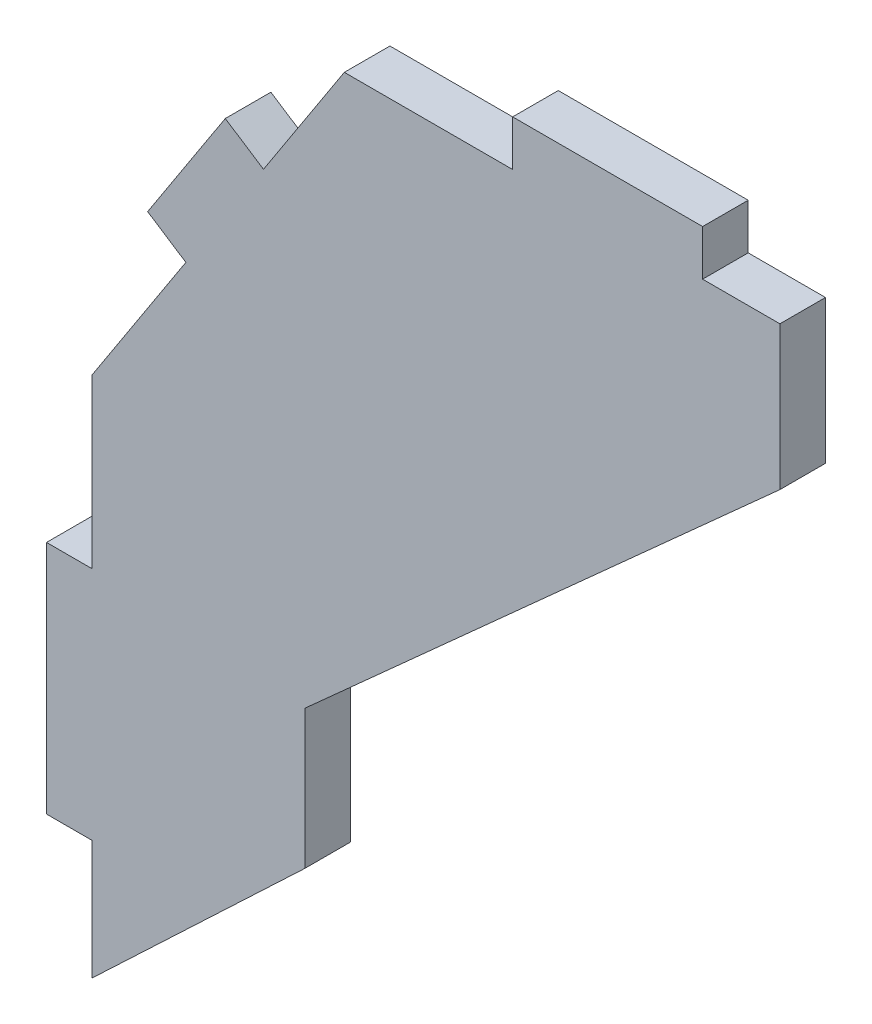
ISO-10303-21;
HEADER;
FILE_DESCRIPTION(('STEP AP214'),'2;1');
FILE_NAME('part.step','',(''),(''),'','','');
FILE_SCHEMA(('AUTOMOTIVE_DESIGN { 1 0 10303 214 1 1 1 1 }'));
ENDSEC;
DATA;
#1=APPLICATION_CONTEXT('core data for automotive mechanical design processes');
#2=APPLICATION_PROTOCOL_DEFINITION('international standard','automotive_design',2000,#1);
#3=PRODUCT_CONTEXT('',#1,'mechanical');
#4=PRODUCT('Part','Part','',(#3));
#5=PRODUCT_RELATED_PRODUCT_CATEGORY('part','',(#4));
#6=PRODUCT_DEFINITION_FORMATION('','',#4);
#7=PRODUCT_DEFINITION_CONTEXT('part definition',#1,'design');
#8=PRODUCT_DEFINITION('design','',#6,#7);
#9=PRODUCT_DEFINITION_SHAPE('','',#8);
#10=(LENGTH_UNIT() NAMED_UNIT(*) SI_UNIT(.MILLI.,.METRE.));
#11=(NAMED_UNIT(*) PLANE_ANGLE_UNIT() SI_UNIT($,.RADIAN.));
#12=(NAMED_UNIT(*) SI_UNIT($,.STERADIAN.) SOLID_ANGLE_UNIT());
#13=UNCERTAINTY_MEASURE_WITH_UNIT(LENGTH_MEASURE(1.E-05),#10,'distance_accuracy_value','');
#14=(GEOMETRIC_REPRESENTATION_CONTEXT(3) GLOBAL_UNCERTAINTY_ASSIGNED_CONTEXT((#13)) GLOBAL_UNIT_ASSIGNED_CONTEXT((#10,
#11,#12)) REPRESENTATION_CONTEXT('',''));
#15=CARTESIAN_POINT('',(0.,0.,0.));
#16=DIRECTION('',(0.,0.,1.));
#17=DIRECTION('',(1.,0.,0.));
#18=AXIS2_PLACEMENT_3D('',#15,#16,#17);
#19=CARTESIAN_POINT('',(0.,171.841179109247,1.524));
#20=DIRECTION('',(1.,0.,0.));
#21=DIRECTION('',(0.,0.,-1.));
#22=AXIS2_PLACEMENT_3D('',#19,#20,#21);
#23=PLANE('',#22);
#24=DIRECTION('',(0.,-1.,0.));
#25=VECTOR('',#24,1.);
#26=CARTESIAN_POINT('',(0.,171.841179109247,0.));
#27=LINE('',#26,#25);
#28=CARTESIAN_POINT('',(0.,177.453164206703,0.));
#29=VERTEX_POINT('',#28);
#30=CARTESIAN_POINT('',(0.,171.841179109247,0.));
#31=VERTEX_POINT('',#30);
#32=EDGE_CURVE('E198',#29,#31,#27,.T.);
#33=ORIENTED_EDGE('',*,*,#32,.T.);
#34=DIRECTION('',(0.,0.,-1.));
#35=VECTOR('',#34,1.);
#36=CARTESIAN_POINT('',(0.,171.841179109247,1.524));
#37=LINE('',#36,#35);
#38=CARTESIAN_POINT('',(0.,171.841179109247,1.524));
#39=VERTEX_POINT('',#38);
#40=EDGE_CURVE('E11',#39,#31,#37,.T.);
#41=ORIENTED_EDGE('',*,*,#40,.F.);
#42=DIRECTION('',(0.,-1.,0.));
#43=VECTOR('',#42,1.);
#44=CARTESIAN_POINT('',(0.,171.841179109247,1.524));
#45=LINE('',#44,#43);
#46=CARTESIAN_POINT('',(0.,177.453164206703,1.524));
#47=VERTEX_POINT('',#46);
#48=EDGE_CURVE('E234',#47,#39,#45,.T.);
#49=ORIENTED_EDGE('',*,*,#48,.F.);
#50=DIRECTION('',(0.,0.,-1.));
#51=VECTOR('',#50,1.);
#52=CARTESIAN_POINT('',(0.,177.453164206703,1.524));
#53=LINE('',#52,#51);
#54=EDGE_CURVE('E194',#47,#29,#53,.T.);
#55=ORIENTED_EDGE('',*,*,#54,.T.);
#56=EDGE_LOOP('',(#33,#41,#49,#55));
#57=FACE_BOUND('',#56,.T.);
#58=ADVANCED_FACE('F36',(#57),#23,.F.);
#59=CARTESIAN_POINT('',(0.,171.841179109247,1.524));
#60=DIRECTION('',(0.,-1.,0.));
#61=DIRECTION('',(0.,0.,-1.));
#62=AXIS2_PLACEMENT_3D('',#59,#60,#61);
#63=PLANE('',#62);
#64=DIRECTION('',(-1.,0.,0.));
#65=VECTOR('',#64,1.);
#66=CARTESIAN_POINT('',(0.,171.841179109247,0.));
#67=LINE('',#66,#65);
#68=CARTESIAN_POINT('',(-1.524,171.841179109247,0.));
#69=VERTEX_POINT('',#68);
#70=EDGE_CURVE('E201',#31,#69,#67,.T.);
#71=ORIENTED_EDGE('',*,*,#70,.T.);
#72=DIRECTION('',(0.,0.,-1.));
#73=VECTOR('',#72,1.);
#74=CARTESIAN_POINT('',(-1.524,171.841179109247,1.524));
#75=LINE('',#74,#73);
#76=CARTESIAN_POINT('',(-1.524,171.841179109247,1.524));
#77=VERTEX_POINT('',#76);
#78=EDGE_CURVE('E44',#77,#69,#75,.T.);
#79=ORIENTED_EDGE('',*,*,#78,.F.);
#80=DIRECTION('',(-1.,0.,0.));
#81=VECTOR('',#80,1.);
#82=CARTESIAN_POINT('',(0.,171.841179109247,1.524));
#83=LINE('',#82,#81);
#84=EDGE_CURVE('E128',#39,#77,#83,.T.);
#85=ORIENTED_EDGE('',*,*,#84,.F.);
#86=ORIENTED_EDGE('',*,*,#40,.T.);
#87=EDGE_LOOP('',(#71,#79,#85,#86));
#88=FACE_BOUND('',#87,.T.);
#89=ADVANCED_FACE('F347',(#88),#63,.F.);
#90=CARTESIAN_POINT('',(-1.524,171.841179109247,1.524));
#91=DIRECTION('',(1.,0.,0.));
#92=DIRECTION('',(0.,0.,-1.));
#93=AXIS2_PLACEMENT_3D('',#90,#91,#92);
#94=PLANE('',#93);
#95=DIRECTION('',(0.,-1.,0.));
#96=VECTOR('',#95,1.);
#97=CARTESIAN_POINT('',(-1.524,171.841179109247,0.));
#98=LINE('',#97,#96);
#99=CARTESIAN_POINT('',(-1.524,163.976275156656,0.));
#100=VERTEX_POINT('',#99);
#101=EDGE_CURVE('E203',#69,#100,#98,.T.);
#102=ORIENTED_EDGE('',*,*,#101,.T.);
#103=DIRECTION('',(0.,0.,-1.));
#104=VECTOR('',#103,1.);
#105=CARTESIAN_POINT('',(-1.524,163.976275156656,1.524));
#106=LINE('',#105,#104);
#107=CARTESIAN_POINT('',(-1.524,163.976275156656,1.524));
#108=VERTEX_POINT('',#107);
#109=EDGE_CURVE('E274',#108,#100,#106,.T.);
#110=ORIENTED_EDGE('',*,*,#109,.F.);
#111=DIRECTION('',(0.,-1.,0.));
#112=VECTOR('',#111,1.);
#113=CARTESIAN_POINT('',(-1.524,171.841179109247,1.524));
#114=LINE('',#113,#112);
#115=EDGE_CURVE('E282',#77,#108,#114,.T.);
#116=ORIENTED_EDGE('',*,*,#115,.F.);
#117=ORIENTED_EDGE('',*,*,#78,.T.);
#118=EDGE_LOOP('',(#102,#110,#116,#117));
#119=FACE_BOUND('',#118,.T.);
#120=ADVANCED_FACE('F280',(#119),#94,.F.);
#121=CARTESIAN_POINT('',(-1.524,163.976275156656,1.524));
#122=DIRECTION('',(0.,1.,0.));
#123=DIRECTION('',(0.,0.,1.));
#124=AXIS2_PLACEMENT_3D('',#121,#122,#123);
#125=PLANE('',#124);
#126=DIRECTION('',(1.,0.,0.));
#127=VECTOR('',#126,1.);
#128=CARTESIAN_POINT('',(-1.524,163.976275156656,0.));
#129=LINE('',#128,#127);
#130=CARTESIAN_POINT('',(0.,163.976275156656,0.));
#131=VERTEX_POINT('',#130);
#132=EDGE_CURVE('E205',#100,#131,#129,.T.);
#133=ORIENTED_EDGE('',*,*,#132,.T.);
#134=DIRECTION('',(0.,0.,-1.));
#135=VECTOR('',#134,1.);
#136=CARTESIAN_POINT('',(0.,163.976275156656,1.524));
#137=LINE('',#136,#135);
#138=CARTESIAN_POINT('',(0.,163.976275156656,1.524));
#139=VERTEX_POINT('',#138);
#140=EDGE_CURVE('E271',#139,#131,#137,.T.);
#141=ORIENTED_EDGE('',*,*,#140,.F.);
#142=DIRECTION('',(1.,0.,0.));
#143=VECTOR('',#142,1.);
#144=CARTESIAN_POINT('',(-1.524,163.976275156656,1.524));
#145=LINE('',#144,#143);
#146=EDGE_CURVE('E300',#108,#139,#145,.T.);
#147=ORIENTED_EDGE('',*,*,#146,.F.);
#148=ORIENTED_EDGE('',*,*,#109,.T.);
#149=EDGE_LOOP('',(#133,#141,#147,#148));
#150=FACE_BOUND('',#149,.T.);
#151=ADVANCED_FACE('F291',(#150),#125,.F.);
#152=CARTESIAN_POINT('',(0.,163.976275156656,1.524));
#153=DIRECTION('',(1.,0.,0.));
#154=DIRECTION('',(0.,0.,-1.));
#155=AXIS2_PLACEMENT_3D('',#152,#153,#154);
#156=PLANE('',#155);
#157=DIRECTION('',(0.,-1.,0.));
#158=VECTOR('',#157,1.);
#159=CARTESIAN_POINT('',(0.,163.976275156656,0.));
#160=LINE('',#159,#158);
#161=CARTESIAN_POINT('',(0.,159.993162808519,0.));
#162=VERTEX_POINT('',#161);
#163=EDGE_CURVE('E207',#131,#162,#160,.T.);
#164=ORIENTED_EDGE('',*,*,#163,.T.);
#165=DIRECTION('',(0.,0.,-1.));
#166=VECTOR('',#165,1.);
#167=CARTESIAN_POINT('',(0.,159.993162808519,1.524));
#168=LINE('',#167,#166);
#169=CARTESIAN_POINT('',(0.,159.993162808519,1.524));
#170=VERTEX_POINT('',#169);
#171=EDGE_CURVE('E268',#170,#162,#168,.T.);
#172=ORIENTED_EDGE('',*,*,#171,.F.);
#173=DIRECTION('',(0.,-1.,0.));
#174=VECTOR('',#173,1.);
#175=CARTESIAN_POINT('',(0.,163.976275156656,1.524));
#176=LINE('',#175,#174);
#177=EDGE_CURVE('E297',#139,#170,#176,.T.);
#178=ORIENTED_EDGE('',*,*,#177,.F.);
#179=ORIENTED_EDGE('',*,*,#140,.T.);
#180=EDGE_LOOP('',(#164,#172,#178,#179));
#181=FACE_BOUND('',#180,.T.);
#182=ADVANCED_FACE('F295',(#181),#156,.F.);
#183=CARTESIAN_POINT('',(0.,159.993162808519,1.524));
#184=DIRECTION('',(-0.687255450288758,0.72641582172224,0.));
#185=DIRECTION('',(-0.72641582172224,-0.687255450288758,0.));
#186=AXIS2_PLACEMENT_3D('',#183,#184,#185);
#187=PLANE('',#186);
#188=DIRECTION('',(0.72641582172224,0.687255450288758,0.));
#189=VECTOR('',#188,1.);
#190=CARTESIAN_POINT('',(0.,159.993162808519,0.));
#191=LINE('',#190,#189);
#192=CARTESIAN_POINT('',(7.11586618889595,166.725419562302,0.));
#193=VERTEX_POINT('',#192);
#194=EDGE_CURVE('E209',#162,#193,#191,.T.);
#195=ORIENTED_EDGE('',*,*,#194,.T.);
#196=DIRECTION('',(0.,0.,-1.));
#197=VECTOR('',#196,1.);
#198=CARTESIAN_POINT('',(7.11586618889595,166.725419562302,1.524));
#199=LINE('',#198,#197);
#200=CARTESIAN_POINT('',(7.11586618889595,166.725419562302,1.524));
#201=VERTEX_POINT('',#200);
#202=EDGE_CURVE('E265',#201,#193,#199,.T.);
#203=ORIENTED_EDGE('',*,*,#202,.F.);
#204=DIRECTION('',(0.72641582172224,0.687255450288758,0.));
#205=VECTOR('',#204,1.);
#206=CARTESIAN_POINT('',(0.,159.993162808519,1.524));
#207=LINE('',#206,#205);
#208=EDGE_CURVE('E299',#170,#201,#207,.T.);
#209=ORIENTED_EDGE('',*,*,#208,.F.);
#210=ORIENTED_EDGE('',*,*,#171,.T.);
#211=EDGE_LOOP('',(#195,#203,#209,#210));
#212=FACE_BOUND('',#211,.T.);
#213=ADVANCED_FACE('F360',(#212),#187,.F.);
#214=CARTESIAN_POINT('',(7.11586618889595,166.725419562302,1.524));
#215=DIRECTION('',(-1.,0.,0.));
#216=DIRECTION('',(0.,0.,1.));
#217=AXIS2_PLACEMENT_3D('',#214,#215,#216);
#218=PLANE('',#217);
#219=DIRECTION('',(0.,1.,0.));
#220=VECTOR('',#219,1.);
#221=CARTESIAN_POINT('',(7.11586618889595,166.725419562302,0.));
#222=LINE('',#221,#220);
#223=CARTESIAN_POINT('',(7.11586618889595,171.362408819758,0.));
#224=VERTEX_POINT('',#223);
#225=EDGE_CURVE('E211',#193,#224,#222,.T.);
#226=ORIENTED_EDGE('',*,*,#225,.T.);
#227=DIRECTION('',(0.,0.,-1.));
#228=VECTOR('',#227,1.);
#229=CARTESIAN_POINT('',(7.11586618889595,171.362408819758,1.524));
#230=LINE('',#229,#228);
#231=CARTESIAN_POINT('',(7.11586618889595,171.362408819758,1.524));
#232=VERTEX_POINT('',#231);
#233=EDGE_CURVE('E262',#232,#224,#230,.T.);
#234=ORIENTED_EDGE('',*,*,#233,.F.);
#235=DIRECTION('',(0.,1.,0.));
#236=VECTOR('',#235,1.);
#237=CARTESIAN_POINT('',(7.11586618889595,166.725419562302,1.524));
#238=LINE('',#237,#236);
#239=EDGE_CURVE('E302',#201,#232,#238,.T.);
#240=ORIENTED_EDGE('',*,*,#239,.F.);
#241=ORIENTED_EDGE('',*,*,#202,.T.);
#242=EDGE_LOOP('',(#226,#234,#240,#241));
#243=FACE_BOUND('',#242,.T.);
#244=ADVANCED_FACE('F363',(#243),#218,.F.);
#245=CARTESIAN_POINT('',(22.9917035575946,185.627136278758,1.524));
#246=DIRECTION('',(-0.668355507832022,0.743841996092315,0.));
#247=DIRECTION('',(-0.743841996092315,-0.668355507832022,0.));
#248=AXIS2_PLACEMENT_3D('',#245,#246,#247);
#249=PLANE('',#248);
#250=DIRECTION('',(0.743841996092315,0.668355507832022,0.));
#251=VECTOR('',#250,1.);
#252=CARTESIAN_POINT('',(22.9917035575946,185.627136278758,0.));
#253=LINE('',#252,#251);
#254=CARTESIAN_POINT('',(22.9917035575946,185.627136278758,0.));
#255=VERTEX_POINT('',#254);
#256=EDGE_CURVE('E213',#224,#255,#253,.T.);
#257=ORIENTED_EDGE('',*,*,#256,.T.);
#258=DIRECTION('',(0.,0.,-1.));
#259=VECTOR('',#258,1.);
#260=CARTESIAN_POINT('',(22.9917035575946,185.627136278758,1.524));
#261=LINE('',#260,#259);
#262=CARTESIAN_POINT('',(22.9917035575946,185.627136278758,1.524));
#263=VERTEX_POINT('',#262);
#264=EDGE_CURVE('E259',#263,#255,#261,.T.);
#265=ORIENTED_EDGE('',*,*,#264,.F.);
#266=DIRECTION('',(0.743841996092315,0.668355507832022,0.));
#267=VECTOR('',#266,1.);
#268=CARTESIAN_POINT('',(22.9917035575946,185.627136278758,1.524));
#269=LINE('',#268,#267);
#270=EDGE_CURVE('E308',#232,#263,#269,.T.);
#271=ORIENTED_EDGE('',*,*,#270,.F.);
#272=ORIENTED_EDGE('',*,*,#233,.T.);
#273=EDGE_LOOP('',(#257,#265,#271,#272));
#274=FACE_BOUND('',#273,.T.);
#275=ADVANCED_FACE('F367',(#274),#249,.F.);
#276=CARTESIAN_POINT('',(22.9917035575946,190.42807538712,1.524));
#277=DIRECTION('',(-1.,0.,0.));
#278=DIRECTION('',(0.,0.,1.));
#279=AXIS2_PLACEMENT_3D('',#276,#277,#278);
#280=PLANE('',#279);
#281=DIRECTION('',(0.,1.,0.));
#282=VECTOR('',#281,1.);
#283=CARTESIAN_POINT('',(22.9917035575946,190.42807538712,0.));
#284=LINE('',#283,#282);
#285=CARTESIAN_POINT('',(22.9917035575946,190.42807538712,0.));
#286=VERTEX_POINT('',#285);
#287=EDGE_CURVE('E215',#255,#286,#284,.T.);
#288=ORIENTED_EDGE('',*,*,#287,.T.);
#289=DIRECTION('',(0.,0.,-1.));
#290=VECTOR('',#289,1.);
#291=CARTESIAN_POINT('',(22.9917035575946,190.42807538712,1.524));
#292=LINE('',#291,#290);
#293=CARTESIAN_POINT('',(22.9917035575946,190.42807538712,1.524));
#294=VERTEX_POINT('',#293);
#295=EDGE_CURVE('E256',#294,#286,#292,.T.);
#296=ORIENTED_EDGE('',*,*,#295,.F.);
#297=DIRECTION('',(0.,1.,0.));
#298=VECTOR('',#297,1.);
#299=CARTESIAN_POINT('',(22.9917035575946,190.42807538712,1.524));
#300=LINE('',#299,#298);
#301=EDGE_CURVE('E310',#263,#294,#300,.T.);
#302=ORIENTED_EDGE('',*,*,#301,.F.);
#303=ORIENTED_EDGE('',*,*,#264,.T.);
#304=EDGE_LOOP('',(#288,#296,#302,#303));
#305=FACE_BOUND('',#304,.T.);
#306=ADVANCED_FACE('F371',(#305),#280,.F.);
#307=CARTESIAN_POINT('',(20.4085106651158,190.42807538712,1.524));
#308=DIRECTION('',(0.,-1.,0.));
#309=DIRECTION('',(0.,0.,-1.));
#310=AXIS2_PLACEMENT_3D('',#307,#308,#309);
#311=PLANE('',#310);
#312=DIRECTION('',(-1.,0.,0.));
#313=VECTOR('',#312,1.);
#314=CARTESIAN_POINT('',(20.4085106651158,190.42807538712,0.));
#315=LINE('',#314,#313);
#316=CARTESIAN_POINT('',(20.4085106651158,190.42807538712,0.));
#317=VERTEX_POINT('',#316);
#318=EDGE_CURVE('E217',#286,#317,#315,.T.);
#319=ORIENTED_EDGE('',*,*,#318,.T.);
#320=DIRECTION('',(0.,0.,-1.));
#321=VECTOR('',#320,1.);
#322=CARTESIAN_POINT('',(20.4085106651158,190.42807538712,1.524));
#323=LINE('',#322,#321);
#324=CARTESIAN_POINT('',(20.4085106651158,190.42807538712,1.524));
#325=VERTEX_POINT('',#324);
#326=EDGE_CURVE('E253',#325,#317,#323,.T.);
#327=ORIENTED_EDGE('',*,*,#326,.F.);
#328=DIRECTION('',(-1.,0.,0.));
#329=VECTOR('',#328,1.);
#330=CARTESIAN_POINT('',(20.4085106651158,190.42807538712,1.524));
#331=LINE('',#330,#329);
#332=EDGE_CURVE('E312',#294,#325,#331,.T.);
#333=ORIENTED_EDGE('',*,*,#332,.F.);
#334=ORIENTED_EDGE('',*,*,#295,.T.);
#335=EDGE_LOOP('',(#319,#327,#333,#334));
#336=FACE_BOUND('',#335,.T.);
#337=ADVANCED_FACE('F375',(#336),#311,.F.);
#338=CARTESIAN_POINT('',(20.4085106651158,191.95207538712,1.524));
#339=DIRECTION('',(-1.,0.,0.));
#340=DIRECTION('',(0.,0.,1.));
#341=AXIS2_PLACEMENT_3D('',#338,#339,#340);
#342=PLANE('',#341);
#343=DIRECTION('',(0.,1.,0.));
#344=VECTOR('',#343,1.);
#345=CARTESIAN_POINT('',(20.4085106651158,191.95207538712,0.));
#346=LINE('',#345,#344);
#347=CARTESIAN_POINT('',(20.4085106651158,191.95207538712,0.));
#348=VERTEX_POINT('',#347);
#349=EDGE_CURVE('E219',#317,#348,#346,.T.);
#350=ORIENTED_EDGE('',*,*,#349,.T.);
#351=DIRECTION('',(0.,0.,-1.));
#352=VECTOR('',#351,1.);
#353=CARTESIAN_POINT('',(20.4085106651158,191.95207538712,1.524));
#354=LINE('',#353,#352);
#355=CARTESIAN_POINT('',(20.4085106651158,191.95207538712,1.524));
#356=VERTEX_POINT('',#355);
#357=EDGE_CURVE('E250',#356,#348,#354,.T.);
#358=ORIENTED_EDGE('',*,*,#357,.F.);
#359=DIRECTION('',(0.,1.,0.));
#360=VECTOR('',#359,1.);
#361=CARTESIAN_POINT('',(20.4085106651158,191.95207538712,1.524));
#362=LINE('',#361,#360);
#363=EDGE_CURVE('E314',#325,#356,#362,.T.);
#364=ORIENTED_EDGE('',*,*,#363,.F.);
#365=ORIENTED_EDGE('',*,*,#326,.T.);
#366=EDGE_LOOP('',(#350,#358,#364,#365));
#367=FACE_BOUND('',#366,.T.);
#368=ADVANCED_FACE('F379',(#367),#342,.F.);
#369=CARTESIAN_POINT('',(14.0585106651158,191.95207538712,1.524));
#370=DIRECTION('',(0.,-1.,0.));
#371=DIRECTION('',(0.,0.,-1.));
#372=AXIS2_PLACEMENT_3D('',#369,#370,#371);
#373=PLANE('',#372);
#374=DIRECTION('',(-1.,0.,0.));
#375=VECTOR('',#374,1.);
#376=CARTESIAN_POINT('',(14.0585106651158,191.95207538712,0.));
#377=LINE('',#376,#375);
#378=CARTESIAN_POINT('',(14.0585106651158,191.95207538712,0.));
#379=VERTEX_POINT('',#378);
#380=EDGE_CURVE('E221',#348,#379,#377,.T.);
#381=ORIENTED_EDGE('',*,*,#380,.T.);
#382=DIRECTION('',(0.,0.,-1.));
#383=VECTOR('',#382,1.);
#384=CARTESIAN_POINT('',(14.0585106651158,191.95207538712,1.524));
#385=LINE('',#384,#383);
#386=CARTESIAN_POINT('',(14.0585106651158,191.95207538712,1.524));
#387=VERTEX_POINT('',#386);
#388=EDGE_CURVE('E247',#387,#379,#385,.T.);
#389=ORIENTED_EDGE('',*,*,#388,.F.);
#390=DIRECTION('',(-1.,0.,0.));
#391=VECTOR('',#390,1.);
#392=CARTESIAN_POINT('',(14.0585106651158,191.95207538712,1.524));
#393=LINE('',#392,#391);
#394=EDGE_CURVE('E316',#356,#387,#393,.T.);
#395=ORIENTED_EDGE('',*,*,#394,.F.);
#396=ORIENTED_EDGE('',*,*,#357,.T.);
#397=EDGE_LOOP('',(#381,#389,#395,#396));
#398=FACE_BOUND('',#397,.T.);
#399=ADVANCED_FACE('F383',(#398),#373,.F.);
#400=CARTESIAN_POINT('',(14.0585106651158,190.42807538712,1.524));
#401=DIRECTION('',(1.,0.,0.));
#402=DIRECTION('',(0.,0.,-1.));
#403=AXIS2_PLACEMENT_3D('',#400,#401,#402);
#404=PLANE('',#403);
#405=DIRECTION('',(0.,-1.,0.));
#406=VECTOR('',#405,1.);
#407=CARTESIAN_POINT('',(14.0585106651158,190.42807538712,0.));
#408=LINE('',#407,#406);
#409=CARTESIAN_POINT('',(14.0585106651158,190.42807538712,0.));
#410=VERTEX_POINT('',#409);
#411=EDGE_CURVE('E223',#379,#410,#408,.T.);
#412=ORIENTED_EDGE('',*,*,#411,.T.);
#413=DIRECTION('',(0.,0.,-1.));
#414=VECTOR('',#413,1.);
#415=CARTESIAN_POINT('',(14.0585106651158,190.42807538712,1.524));
#416=LINE('',#415,#414);
#417=CARTESIAN_POINT('',(14.0585106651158,190.42807538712,1.524));
#418=VERTEX_POINT('',#417);
#419=EDGE_CURVE('E244',#418,#410,#416,.T.);
#420=ORIENTED_EDGE('',*,*,#419,.F.);
#421=DIRECTION('',(0.,-1.,0.));
#422=VECTOR('',#421,1.);
#423=CARTESIAN_POINT('',(14.0585106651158,190.42807538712,1.524));
#424=LINE('',#423,#422);
#425=EDGE_CURVE('E318',#387,#418,#424,.T.);
#426=ORIENTED_EDGE('',*,*,#425,.F.);
#427=ORIENTED_EDGE('',*,*,#388,.T.);
#428=EDGE_LOOP('',(#412,#420,#426,#427));
#429=FACE_BOUND('',#428,.T.);
#430=ADVANCED_FACE('F387',(#429),#404,.F.);
#431=CARTESIAN_POINT('',(8.43141488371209,190.42807538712,1.524));
#432=DIRECTION('',(0.,-1.,0.));
#433=DIRECTION('',(0.,0.,-1.));
#434=AXIS2_PLACEMENT_3D('',#431,#432,#433);
#435=PLANE('',#434);
#436=DIRECTION('',(-1.,0.,0.));
#437=VECTOR('',#436,1.);
#438=CARTESIAN_POINT('',(8.43141488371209,190.42807538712,0.));
#439=LINE('',#438,#437);
#440=CARTESIAN_POINT('',(8.43141488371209,190.42807538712,0.));
#441=VERTEX_POINT('',#440);
#442=EDGE_CURVE('E225',#410,#441,#439,.T.);
#443=ORIENTED_EDGE('',*,*,#442,.T.);
#444=DIRECTION('',(0.,0.,-1.));
#445=VECTOR('',#444,1.);
#446=CARTESIAN_POINT('',(8.43141488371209,190.42807538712,1.524));
#447=LINE('',#446,#445);
#448=CARTESIAN_POINT('',(8.43141488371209,190.42807538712,1.524));
#449=VERTEX_POINT('',#448);
#450=EDGE_CURVE('E241',#449,#441,#447,.T.);
#451=ORIENTED_EDGE('',*,*,#450,.F.);
#452=DIRECTION('',(-1.,0.,0.));
#453=VECTOR('',#452,1.);
#454=CARTESIAN_POINT('',(8.43141488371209,190.42807538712,1.524));
#455=LINE('',#454,#453);
#456=EDGE_CURVE('E320',#418,#449,#455,.T.);
#457=ORIENTED_EDGE('',*,*,#456,.F.);
#458=ORIENTED_EDGE('',*,*,#419,.T.);
#459=EDGE_LOOP('',(#443,#451,#457,#458));
#460=FACE_BOUND('',#459,.T.);
#461=ADVANCED_FACE('F391',(#460),#435,.F.);
#462=CARTESIAN_POINT('',(5.72978361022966,186.270596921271,1.524));
#463=DIRECTION('',(0.83851086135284,-0.544884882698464,0.));
#464=DIRECTION('',(0.544884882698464,0.83851086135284,0.));
#465=AXIS2_PLACEMENT_3D('',#462,#463,#464);
#466=PLANE('',#465);
#467=DIRECTION('',(-0.544884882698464,-0.838510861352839,0.));
#468=VECTOR('',#467,1.);
#469=CARTESIAN_POINT('',(5.72978361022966,186.270596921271,0.));
#470=LINE('',#469,#468);
#471=CARTESIAN_POINT('',(5.72978361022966,186.270596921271,0.));
#472=VERTEX_POINT('',#471);
#473=EDGE_CURVE('E227',#441,#472,#470,.T.);
#474=ORIENTED_EDGE('',*,*,#473,.T.);
#475=DIRECTION('',(0.,0.,-1.));
#476=VECTOR('',#475,1.);
#477=CARTESIAN_POINT('',(5.72978361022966,186.270596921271,1.524));
#478=LINE('',#477,#476);
#479=CARTESIAN_POINT('',(5.72978361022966,186.270596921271,1.524));
#480=VERTEX_POINT('',#479);
#481=EDGE_CURVE('E238',#480,#472,#478,.T.);
#482=ORIENTED_EDGE('',*,*,#481,.F.);
#483=DIRECTION('',(-0.544884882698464,-0.838510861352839,0.));
#484=VECTOR('',#483,1.);
#485=CARTESIAN_POINT('',(5.72978361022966,186.270596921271,1.524));
#486=LINE('',#485,#484);
#487=EDGE_CURVE('E322',#449,#480,#486,.T.);
#488=ORIENTED_EDGE('',*,*,#487,.F.);
#489=ORIENTED_EDGE('',*,*,#450,.T.);
#490=EDGE_LOOP('',(#474,#482,#488,#489));
#491=FACE_BOUND('',#490,.T.);
#492=ADVANCED_FACE('F328',(#491),#466,.F.);
#493=CARTESIAN_POINT('',(4.45189305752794,187.101001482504,1.524));
#494=DIRECTION('',(-0.544884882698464,-0.838510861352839,0.));
#495=DIRECTION('',(0.838510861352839,-0.544884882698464,0.));
#496=AXIS2_PLACEMENT_3D('',#493,#494,#495);
#497=PLANE('',#496);
#498=DIRECTION('',(-0.838510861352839,0.544884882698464,0.));
#499=VECTOR('',#498,1.);
#500=CARTESIAN_POINT('',(4.45189305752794,187.101001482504,0.));
#501=LINE('',#500,#499);
#502=CARTESIAN_POINT('',(4.45189305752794,187.101001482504,0.));
#503=VERTEX_POINT('',#502);
#504=EDGE_CURVE('E229',#472,#503,#501,.T.);
#505=ORIENTED_EDGE('',*,*,#504,.T.);
#506=DIRECTION('',(0.,0.,-1.));
#507=VECTOR('',#506,1.);
#508=CARTESIAN_POINT('',(4.45189305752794,187.101001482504,1.524));
#509=LINE('',#508,#507);
#510=CARTESIAN_POINT('',(4.45189305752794,187.101001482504,1.524));
#511=VERTEX_POINT('',#510);
#512=EDGE_CURVE('E189',#511,#503,#509,.T.);
#513=ORIENTED_EDGE('',*,*,#512,.F.);
#514=DIRECTION('',(-0.838510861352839,0.544884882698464,0.));
#515=VECTOR('',#514,1.);
#516=CARTESIAN_POINT('',(4.45189305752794,187.101001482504,1.524));
#517=LINE('',#516,#515);
#518=EDGE_CURVE('E180',#480,#511,#517,.T.);
#519=ORIENTED_EDGE('',*,*,#518,.F.);
#520=ORIENTED_EDGE('',*,*,#481,.T.);
#521=EDGE_LOOP('',(#505,#513,#519,#520));
#522=FACE_BOUND('',#521,.T.);
#523=ADVANCED_FACE('F332',(#522),#497,.F.);
#524=CARTESIAN_POINT('',(1.85687880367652,183.107593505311,1.524));
#525=DIRECTION('',(0.83851086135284,-0.544884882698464,0.));
#526=DIRECTION('',(0.544884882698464,0.83851086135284,0.));
#527=AXIS2_PLACEMENT_3D('',#524,#525,#526);
#528=PLANE('',#527);
#529=DIRECTION('',(-0.544884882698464,-0.83851086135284,0.));
#530=VECTOR('',#529,1.);
#531=CARTESIAN_POINT('',(1.85687880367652,183.107593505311,0.));
#532=LINE('',#531,#530);
#533=CARTESIAN_POINT('',(1.85687880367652,183.107593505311,0.));
#534=VERTEX_POINT('',#533);
#535=EDGE_CURVE('E188',#503,#534,#532,.T.);
#536=ORIENTED_EDGE('',*,*,#535,.T.);
#537=DIRECTION('',(0.,0.,-1.));
#538=VECTOR('',#537,1.);
#539=CARTESIAN_POINT('',(1.85687880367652,183.107593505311,1.524));
#540=LINE('',#539,#538);
#541=CARTESIAN_POINT('',(1.85687880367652,183.107593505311,1.524));
#542=VERTEX_POINT('',#541);
#543=EDGE_CURVE('E185',#542,#534,#540,.T.);
#544=ORIENTED_EDGE('',*,*,#543,.F.);
#545=DIRECTION('',(-0.544884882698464,-0.83851086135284,0.));
#546=VECTOR('',#545,1.);
#547=CARTESIAN_POINT('',(1.85687880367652,183.107593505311,1.524));
#548=LINE('',#547,#546);
#549=EDGE_CURVE('E174',#511,#542,#548,.T.);
#550=ORIENTED_EDGE('',*,*,#549,.F.);
#551=ORIENTED_EDGE('',*,*,#512,.T.);
#552=EDGE_LOOP('',(#536,#544,#550,#551));
#553=FACE_BOUND('',#552,.T.);
#554=ADVANCED_FACE('F186',(#553),#528,.F.);
#555=CARTESIAN_POINT('',(3.13476935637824,182.277188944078,1.524));
#556=DIRECTION('',(0.544884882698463,0.83851086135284,0.));
#557=DIRECTION('',(-0.83851086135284,0.544884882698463,0.));
#558=AXIS2_PLACEMENT_3D('',#555,#556,#557);
#559=PLANE('',#558);
#560=DIRECTION('',(0.83851086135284,-0.544884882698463,0.));
#561=VECTOR('',#560,1.);
#562=CARTESIAN_POINT('',(3.13476935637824,182.277188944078,0.));
#563=LINE('',#562,#561);
#564=CARTESIAN_POINT('',(3.13476935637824,182.277188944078,0.));
#565=VERTEX_POINT('',#564);
#566=EDGE_CURVE('E114',#534,#565,#563,.T.);
#567=ORIENTED_EDGE('',*,*,#566,.T.);
#568=DIRECTION('',(0.,0.,-1.));
#569=VECTOR('',#568,1.);
#570=CARTESIAN_POINT('',(3.13476935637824,182.277188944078,1.524));
#571=LINE('',#570,#569);
#572=CARTESIAN_POINT('',(3.13476935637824,182.277188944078,1.524));
#573=VERTEX_POINT('',#572);
#574=EDGE_CURVE('E190',#573,#565,#571,.T.);
#575=ORIENTED_EDGE('',*,*,#574,.F.);
#576=DIRECTION('',(0.83851086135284,-0.544884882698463,0.));
#577=VECTOR('',#576,1.);
#578=CARTESIAN_POINT('',(3.13476935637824,182.277188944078,1.524));
#579=LINE('',#578,#577);
#580=EDGE_CURVE('E178',#542,#573,#579,.T.);
#581=ORIENTED_EDGE('',*,*,#580,.F.);
#582=ORIENTED_EDGE('',*,*,#543,.T.);
#583=EDGE_LOOP('',(#567,#575,#581,#582));
#584=FACE_BOUND('',#583,.T.);
#585=ADVANCED_FACE('F192',(#584),#559,.F.);
#586=CARTESIAN_POINT('',(0.,177.453164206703,1.524));
#587=DIRECTION('',(0.838510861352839,-0.544884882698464,0.));
#588=DIRECTION('',(0.544884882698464,0.83851086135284,0.));
#589=AXIS2_PLACEMENT_3D('',#586,#587,#588);
#590=PLANE('',#589);
#591=DIRECTION('',(-0.544884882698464,-0.838510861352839,0.));
#592=VECTOR('',#591,1.);
#593=CARTESIAN_POINT('',(0.,177.453164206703,0.));
#594=LINE('',#593,#592);
#595=EDGE_CURVE('E120',#565,#29,#594,.T.);
#596=ORIENTED_EDGE('',*,*,#595,.T.);
#597=ORIENTED_EDGE('',*,*,#54,.F.);
#598=DIRECTION('',(-0.544884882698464,-0.838510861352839,0.));
#599=VECTOR('',#598,1.);
#600=CARTESIAN_POINT('',(0.,177.453164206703,1.524));
#601=LINE('',#600,#599);
#602=EDGE_CURVE('E52',#573,#47,#601,.T.);
#603=ORIENTED_EDGE('',*,*,#602,.F.);
#604=ORIENTED_EDGE('',*,*,#574,.T.);
#605=EDGE_LOOP('',(#596,#597,#603,#604));
#606=FACE_BOUND('',#605,.T.);
#607=ADVANCED_FACE('F336',(#606),#590,.F.);
#608=CARTESIAN_POINT('',(0.,0.,1.524));
#609=DIRECTION('',(0.,0.,-1.));
#610=DIRECTION('',(-1.,0.,0.));
#611=AXIS2_PLACEMENT_3D('',#608,#609,#610);
#612=PLANE('',#611);
#613=ORIENTED_EDGE('',*,*,#48,.T.);
#614=ORIENTED_EDGE('',*,*,#84,.T.);
#615=ORIENTED_EDGE('',*,*,#115,.T.);
#616=ORIENTED_EDGE('',*,*,#146,.T.);
#617=ORIENTED_EDGE('',*,*,#177,.T.);
#618=ORIENTED_EDGE('',*,*,#208,.T.);
#619=ORIENTED_EDGE('',*,*,#239,.T.);
#620=ORIENTED_EDGE('',*,*,#270,.T.);
#621=ORIENTED_EDGE('',*,*,#301,.T.);
#622=ORIENTED_EDGE('',*,*,#332,.T.);
#623=ORIENTED_EDGE('',*,*,#363,.T.);
#624=ORIENTED_EDGE('',*,*,#394,.T.);
#625=ORIENTED_EDGE('',*,*,#425,.T.);
#626=ORIENTED_EDGE('',*,*,#456,.T.);
#627=ORIENTED_EDGE('',*,*,#487,.T.);
#628=ORIENTED_EDGE('',*,*,#518,.T.);
#629=ORIENTED_EDGE('',*,*,#549,.T.);
#630=ORIENTED_EDGE('',*,*,#580,.T.);
#631=ORIENTED_EDGE('',*,*,#602,.T.);
#632=EDGE_LOOP('',(#613,#614,#615,#616,#617,#618,#619,#620,#621,#622,#623,#624,#625,#626,#627,
#628,#629,#630,#631));
#633=FACE_BOUND('',#632,.T.);
#634=ADVANCED_FACE('F176',(#633),#612,.F.);
#635=CARTESIAN_POINT('',(0.,0.,0.));
#636=DIRECTION('',(0.,0.,-1.));
#637=DIRECTION('',(-1.,0.,0.));
#638=AXIS2_PLACEMENT_3D('',#635,#636,#637);
#639=PLANE('',#638);
#640=ORIENTED_EDGE('',*,*,#32,.F.);
#641=ORIENTED_EDGE('',*,*,#595,.F.);
#642=ORIENTED_EDGE('',*,*,#566,.F.);
#643=ORIENTED_EDGE('',*,*,#535,.F.);
#644=ORIENTED_EDGE('',*,*,#504,.F.);
#645=ORIENTED_EDGE('',*,*,#473,.F.);
#646=ORIENTED_EDGE('',*,*,#442,.F.);
#647=ORIENTED_EDGE('',*,*,#411,.F.);
#648=ORIENTED_EDGE('',*,*,#380,.F.);
#649=ORIENTED_EDGE('',*,*,#349,.F.);
#650=ORIENTED_EDGE('',*,*,#318,.F.);
#651=ORIENTED_EDGE('',*,*,#287,.F.);
#652=ORIENTED_EDGE('',*,*,#256,.F.);
#653=ORIENTED_EDGE('',*,*,#225,.F.);
#654=ORIENTED_EDGE('',*,*,#194,.F.);
#655=ORIENTED_EDGE('',*,*,#163,.F.);
#656=ORIENTED_EDGE('',*,*,#132,.F.);
#657=ORIENTED_EDGE('',*,*,#101,.F.);
#658=ORIENTED_EDGE('',*,*,#70,.F.);
#659=EDGE_LOOP('',(#640,#641,#642,#643,#644,#645,#646,#647,#648,#649,#650,#651,#652,#653,#654,
#655,#656,#657,#658));
#660=FACE_BOUND('',#659,.T.);
#661=ADVANCED_FACE('F286',(#660),#639,.T.);
#662=CLOSED_SHELL('',(#58,#89,#120,#151,#182,#213,#244,#275,#306,#337,#368,#399,#430,#461,#492,
#523,#554,#585,#607,#634,#661));
#663=MANIFOLD_SOLID_BREP('B2',#662);
#664=ADVANCED_BREP_SHAPE_REPRESENTATION('',(#18,#663),#14);
#665=SHAPE_DEFINITION_REPRESENTATION(#9,#664);
ENDSEC;
END-ISO-10303-21;
